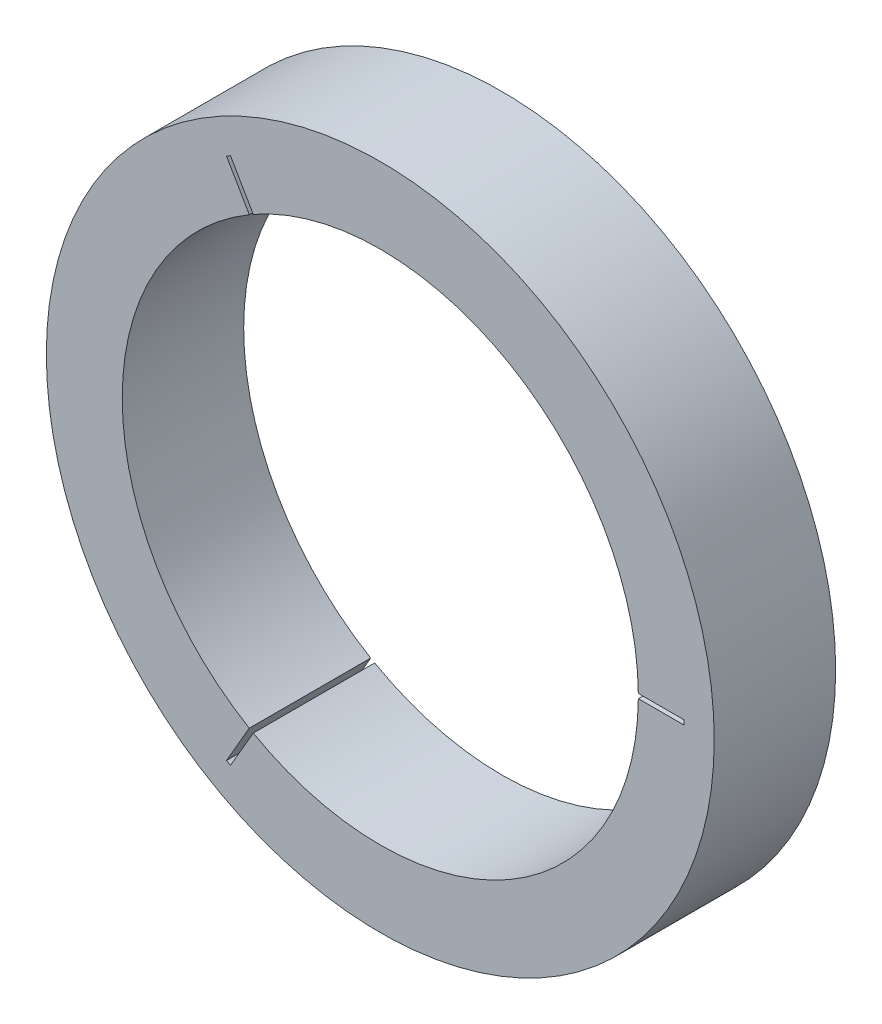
from build123d import *

# Parameters (mm, degrees)
SKETCH1_R          = 110
EXTRUDE1_DEPTH     = 40
SKETCH2_R          = 85
CUT_EXTRUDE1_DEPTH = 161.623784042
SKETCH3_W          = 20
SKETCH3_H          = 1.5
CUT_EXTRUDE2_DEPTH = 161.623784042
CIRPATTERN1_COUNT  = 3


with BuildPart() as part:
    # Sketch1 → Extrude1 (new body)
    with BuildSketch(Plane.XY):
        Circle(SKETCH1_R)
    extrude(amount=EXTRUDE1_DEPTH)

    # Sketch2 → Cut-Extrude1 (cut, through all)
    with BuildSketch(Plane.XY.offset(40)):
        Circle(SKETCH2_R)
    extrude(amount=-CUT_EXTRUDE1_DEPTH, mode=Mode.SUBTRACT)

    # Sketch3 → Cut-Extrude2 (cut, through all)
    with BuildSketch(Plane.XY.offset(40)):
        with Locations((90, 0)):
            Rectangle(SKETCH3_W, SKETCH3_H)
    cut_extrude2 = extrude(amount=-CUT_EXTRUDE2_DEPTH, mode=Mode.SUBTRACT)

    # CirPattern1: Cut-Extrude2 ×3 about axis
    cirpattern1_axis = Axis((0, 0, 0), (0, 0, 1))
    for i in range(1, CIRPATTERN1_COUNT):
        add(cut_extrude2.rotate(cirpattern1_axis, i * 360 / CIRPATTERN1_COUNT), mode=Mode.SUBTRACT)


solid = part.part
